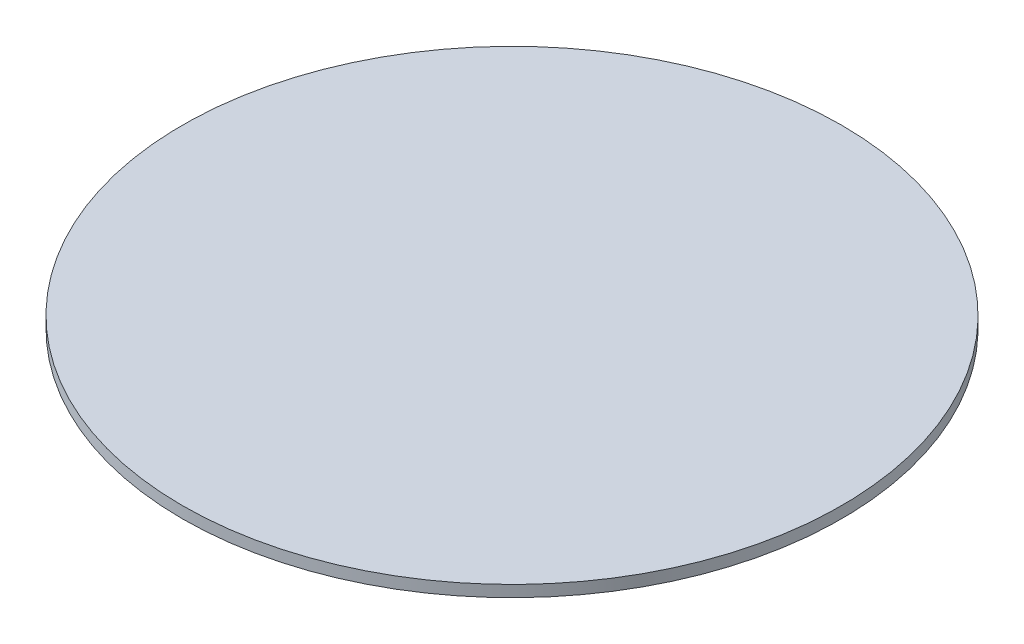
from build123d import *

# Parameters (mm, degrees)
SKETCH2_R           = 460
BOSS_EXTRUDE1_DEPTH = 16


with BuildPart() as part:
    # Sketch2 → Boss-Extrude1 (new body)
    with BuildSketch(Plane(origin=(0, 0, 0), x_dir=(1, 0, 0), z_dir=(0, 1, 0))):
        with Locations(Location((0, 0, 0), (0, 0, 270))):
            Circle(SKETCH2_R)
    extrude(amount=BOSS_EXTRUDE1_DEPTH)


solid = part.part
